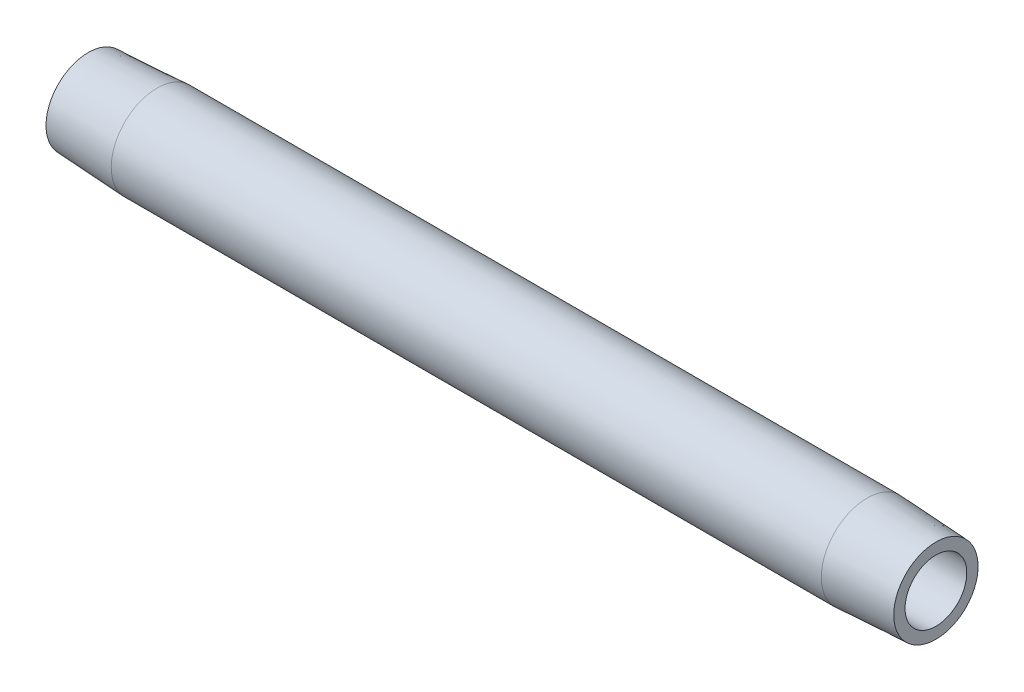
ISO-10303-21;
HEADER;
FILE_DESCRIPTION(('STEP AP214'),'2;1');
FILE_NAME('part.step','',(''),(''),'','','');
FILE_SCHEMA(('AUTOMOTIVE_DESIGN { 1 0 10303 214 1 1 1 1 }'));
ENDSEC;
DATA;
#1=APPLICATION_CONTEXT('core data for automotive mechanical design processes');
#2=APPLICATION_PROTOCOL_DEFINITION('international standard','automotive_design',2000,#1);
#3=PRODUCT_CONTEXT('',#1,'mechanical');
#4=PRODUCT('Part','Part','',(#3));
#5=PRODUCT_RELATED_PRODUCT_CATEGORY('part','',(#4));
#6=PRODUCT_DEFINITION_FORMATION('','',#4);
#7=PRODUCT_DEFINITION_CONTEXT('part definition',#1,'design');
#8=PRODUCT_DEFINITION('design','',#6,#7);
#9=PRODUCT_DEFINITION_SHAPE('','',#8);
#10=(LENGTH_UNIT() NAMED_UNIT(*) SI_UNIT(.MILLI.,.METRE.));
#11=(NAMED_UNIT(*) PLANE_ANGLE_UNIT() SI_UNIT($,.RADIAN.));
#12=(NAMED_UNIT(*) SI_UNIT($,.STERADIAN.) SOLID_ANGLE_UNIT());
#13=UNCERTAINTY_MEASURE_WITH_UNIT(LENGTH_MEASURE(1.E-05),#10,'distance_accuracy_value','');
#14=(GEOMETRIC_REPRESENTATION_CONTEXT(3) GLOBAL_UNCERTAINTY_ASSIGNED_CONTEXT((#13)) GLOBAL_UNIT_ASSIGNED_CONTEXT((#10,
#11,#12)) REPRESENTATION_CONTEXT('',''));
#15=CARTESIAN_POINT('',(0.,0.,0.));
#16=DIRECTION('',(0.,0.,1.));
#17=DIRECTION('',(1.,0.,0.));
#18=AXIS2_PLACEMENT_3D('',#15,#16,#17);
#19=CARTESIAN_POINT('',(127.,0.,-4.62277681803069));
#20=DIRECTION('',(-1.,0.,0.));
#21=DIRECTION('',(0.,0.,1.));
#22=AXIS2_PLACEMENT_3D('',#19,#20,#21);
#23=PLANE('',#22);
#24=CARTESIAN_POINT('',(127.,0.,0.));
#25=DIRECTION('',(-1.,0.,0.));
#26=DIRECTION('',(0.,0.,1.));
#27=AXIS2_PLACEMENT_3D('',#24,#25,#26);
#28=CIRCLE('',#27,6.31752683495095);
#29=CARTESIAN_POINT('',(127.,0.,6.31752683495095));
#30=VERTEX_POINT('',#29);
#31=EDGE_CURVE('E10',#30,#30,#28,.T.);
#32=ORIENTED_EDGE('',*,*,#31,.F.);
#33=EDGE_LOOP('',(#32));
#34=FACE_BOUND('',#33,.T.);
#35=CARTESIAN_POINT('',(127.,0.,0.));
#36=DIRECTION('',(-1.,0.,0.));
#37=DIRECTION('',(0.,0.,1.));
#38=AXIS2_PLACEMENT_3D('',#35,#36,#37);
#39=CIRCLE('',#38,4.62277681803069);
#40=CARTESIAN_POINT('',(127.,0.,4.62277681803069));
#41=VERTEX_POINT('',#40);
#42=EDGE_CURVE('E52',#41,#41,#39,.T.);
#43=ORIENTED_EDGE('',*,*,#42,.T.);
#44=EDGE_LOOP('',(#43));
#45=FACE_BOUND('',#44,.T.);
#46=ADVANCED_FACE('F30',(#34,#45),#23,.F.);
#47=CARTESIAN_POINT('',(127.,0.,0.));
#48=DIRECTION('',(-1.,0.,0.));
#49=DIRECTION('',(0.,0.,1.));
#50=AXIS2_PLACEMENT_3D('',#47,#48,#49);
#51=CONICAL_SURFACE('',#50,6.31752683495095,0.052359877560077);
#52=CARTESIAN_POINT('',(116.687600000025,0.,0.));
#53=DIRECTION('',(-1.,0.,0.));
#54=DIRECTION('',(0.,0.,1.));
#55=AXIS2_PLACEMENT_3D('',#52,#53,#54);
#56=CIRCLE('',#55,6.85797681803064);
#57=CARTESIAN_POINT('',(116.687600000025,0.,6.85797681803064));
#58=VERTEX_POINT('',#57);
#59=EDGE_CURVE('E36',#58,#58,#56,.T.);
#60=ORIENTED_EDGE('',*,*,#59,.F.);
#61=EDGE_LOOP('',(#60));
#62=FACE_BOUND('',#61,.T.);
#63=ORIENTED_EDGE('',*,*,#31,.T.);
#64=EDGE_LOOP('',(#63));
#65=FACE_BOUND('',#64,.T.);
#66=ADVANCED_FACE('F77',(#62,#65),#51,.T.);
#67=CARTESIAN_POINT('',(-6.37599469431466,0.,0.));
#68=DIRECTION('',(-1.,0.,0.));
#69=DIRECTION('',(0.,0.,1.));
#70=AXIS2_PLACEMENT_3D('',#67,#68,#69);
#71=CYLINDRICAL_SURFACE('',#70,6.85797681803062);
#72=CARTESIAN_POINT('',(10.3123999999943,0.,0.));
#73=DIRECTION('',(-1.,0.,0.));
#74=DIRECTION('',(0.,0.,1.));
#75=AXIS2_PLACEMENT_3D('',#72,#73,#74);
#76=CIRCLE('',#75,6.8579768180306);
#77=CARTESIAN_POINT('',(10.3123999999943,0.,6.8579768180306));
#78=VERTEX_POINT('',#77);
#79=EDGE_CURVE('E40',#78,#78,#76,.T.);
#80=ORIENTED_EDGE('',*,*,#79,.F.);
#81=EDGE_LOOP('',(#80));
#82=FACE_BOUND('',#81,.T.);
#83=ORIENTED_EDGE('',*,*,#59,.T.);
#84=EDGE_LOOP('',(#83));
#85=FACE_BOUND('',#84,.T.);
#86=ADVANCED_FACE('F72',(#82,#85),#71,.T.);
#87=CARTESIAN_POINT('',(10.3123999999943,0.,0.));
#88=DIRECTION('',(1.,0.,0.));
#89=DIRECTION('',(0.,0.,-1.));
#90=AXIS2_PLACEMENT_3D('',#87,#88,#89);
#91=CONICAL_SURFACE('',#90,6.8579768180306,0.0523598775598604);
#92=CARTESIAN_POINT('',(1.90819582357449E-11,0.,0.));
#93=DIRECTION('',(-1.,0.,0.));
#94=DIRECTION('',(0.,0.,1.));
#95=AXIS2_PLACEMENT_3D('',#92,#93,#94);
#96=CIRCLE('',#95,6.31752683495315);
#97=CARTESIAN_POINT('',(1.90819582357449E-11,0.,6.31752683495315));
#98=VERTEX_POINT('',#97);
#99=EDGE_CURVE('E44',#98,#98,#96,.T.);
#100=ORIENTED_EDGE('',*,*,#99,.F.);
#101=EDGE_LOOP('',(#100));
#102=FACE_BOUND('',#101,.T.);
#103=ORIENTED_EDGE('',*,*,#79,.T.);
#104=EDGE_LOOP('',(#103));
#105=FACE_BOUND('',#104,.T.);
#106=ADVANCED_FACE('F66',(#102,#105),#91,.T.);
#107=CARTESIAN_POINT('',(1.90819582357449E-11,0.,-6.31752683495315));
#108=DIRECTION('',(1.,0.,0.));
#109=DIRECTION('',(0.,0.,-1.));
#110=AXIS2_PLACEMENT_3D('',#107,#108,#109);
#111=PLANE('',#110);
#112=CARTESIAN_POINT('',(1.90819582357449E-11,0.,0.));
#113=DIRECTION('',(-1.,0.,0.));
#114=DIRECTION('',(0.,0.,1.));
#115=AXIS2_PLACEMENT_3D('',#112,#113,#114);
#116=CIRCLE('',#115,4.62277681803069);
#117=CARTESIAN_POINT('',(1.90819582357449E-11,0.,4.62277681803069));
#118=VERTEX_POINT('',#117);
#119=EDGE_CURVE('E49',#118,#118,#116,.T.);
#120=ORIENTED_EDGE('',*,*,#119,.F.);
#121=EDGE_LOOP('',(#120));
#122=FACE_BOUND('',#121,.T.);
#123=ORIENTED_EDGE('',*,*,#99,.T.);
#124=EDGE_LOOP('',(#123));
#125=FACE_BOUND('',#124,.T.);
#126=ADVANCED_FACE('F60',(#122,#125),#111,.F.);
#127=CARTESIAN_POINT('',(-6.37599469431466,0.,0.));
#128=DIRECTION('',(-1.,0.,0.));
#129=DIRECTION('',(0.,0.,1.));
#130=AXIS2_PLACEMENT_3D('',#127,#128,#129);
#131=CYLINDRICAL_SURFACE('',#130,4.62277681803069);
#132=ORIENTED_EDGE('',*,*,#42,.F.);
#133=EDGE_LOOP('',(#132));
#134=FACE_BOUND('',#133,.T.);
#135=ORIENTED_EDGE('',*,*,#119,.T.);
#136=EDGE_LOOP('',(#135));
#137=FACE_BOUND('',#136,.T.);
#138=ADVANCED_FACE('F57',(#134,#137),#131,.F.);
#139=CLOSED_SHELL('',(#46,#66,#86,#106,#126,#138));
#140=MANIFOLD_SOLID_BREP('B2',#139);
#141=ADVANCED_BREP_SHAPE_REPRESENTATION('',(#18,#140),#14);
#142=SHAPE_DEFINITION_REPRESENTATION(#9,#141);
ENDSEC;
END-ISO-10303-21;
